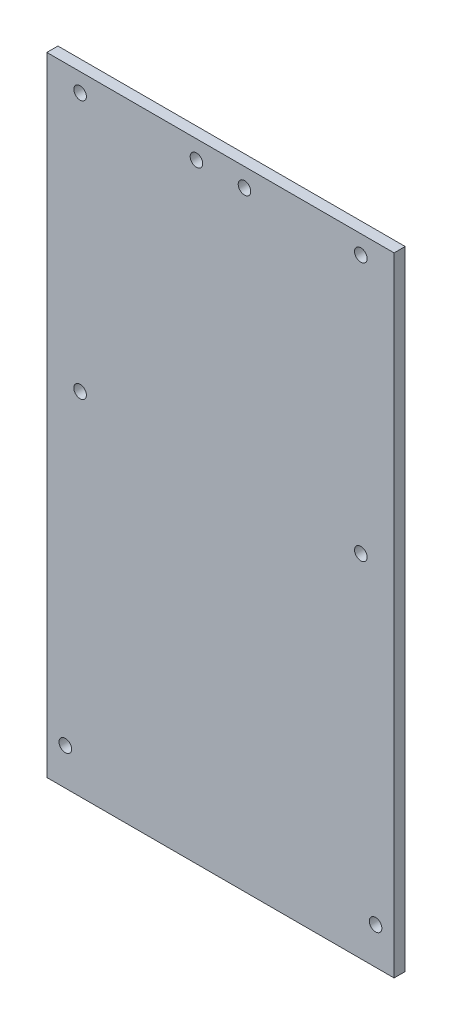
ISO-10303-21;
HEADER;
FILE_DESCRIPTION(('STEP AP214'),'2;1');
FILE_NAME('part.step','',(''),(''),'','','');
FILE_SCHEMA(('AUTOMOTIVE_DESIGN { 1 0 10303 214 1 1 1 1 }'));
ENDSEC;
DATA;
#1=APPLICATION_CONTEXT('core data for automotive mechanical design processes');
#2=APPLICATION_PROTOCOL_DEFINITION('international standard','automotive_design',2000,#1);
#3=PRODUCT_CONTEXT('',#1,'mechanical');
#4=PRODUCT('Part','Part','',(#3));
#5=PRODUCT_RELATED_PRODUCT_CATEGORY('part','',(#4));
#6=PRODUCT_DEFINITION_FORMATION('','',#4);
#7=PRODUCT_DEFINITION_CONTEXT('part definition',#1,'design');
#8=PRODUCT_DEFINITION('design','',#6,#7);
#9=PRODUCT_DEFINITION_SHAPE('','',#8);
#10=(LENGTH_UNIT() NAMED_UNIT(*) SI_UNIT(.MILLI.,.METRE.));
#11=(NAMED_UNIT(*) PLANE_ANGLE_UNIT() SI_UNIT($,.RADIAN.));
#12=(NAMED_UNIT(*) SI_UNIT($,.STERADIAN.) SOLID_ANGLE_UNIT());
#13=UNCERTAINTY_MEASURE_WITH_UNIT(LENGTH_MEASURE(1.E-05),#10,'distance_accuracy_value','');
#14=(GEOMETRIC_REPRESENTATION_CONTEXT(3) GLOBAL_UNCERTAINTY_ASSIGNED_CONTEXT((#13)) GLOBAL_UNIT_ASSIGNED_CONTEXT((#10,
#11,#12)) REPRESENTATION_CONTEXT('',''));
#15=CARTESIAN_POINT('',(0.,0.,0.));
#16=DIRECTION('',(0.,0.,1.));
#17=DIRECTION('',(1.,0.,0.));
#18=AXIS2_PLACEMENT_3D('',#15,#16,#17);
#19=CARTESIAN_POINT('',(47.,85.,3.));
#20=DIRECTION('',(-1.,0.,0.));
#21=DIRECTION('',(0.,-1.,0.));
#22=AXIS2_PLACEMENT_3D('',#19,#20,#21);
#23=PLANE('',#22);
#24=DIRECTION('',(0.,1.,0.));
#25=VECTOR('',#24,1.);
#26=CARTESIAN_POINT('',(47.,85.,0.));
#27=LINE('',#26,#25);
#28=CARTESIAN_POINT('',(47.,-85.,0.));
#29=VERTEX_POINT('',#28);
#30=CARTESIAN_POINT('',(47.,85.,0.));
#31=VERTEX_POINT('',#30);
#32=EDGE_CURVE('E97',#29,#31,#27,.T.);
#33=ORIENTED_EDGE('',*,*,#32,.T.);
#34=DIRECTION('',(0.,0.,-1.));
#35=VECTOR('',#34,1.);
#36=CARTESIAN_POINT('',(47.,85.,3.));
#37=LINE('',#36,#35);
#38=CARTESIAN_POINT('',(47.,85.,3.));
#39=VERTEX_POINT('',#38);
#40=EDGE_CURVE('E11',#39,#31,#37,.T.);
#41=ORIENTED_EDGE('',*,*,#40,.F.);
#42=DIRECTION('',(0.,1.,0.));
#43=VECTOR('',#42,1.);
#44=CARTESIAN_POINT('',(47.,85.,3.));
#45=LINE('',#44,#43);
#46=CARTESIAN_POINT('',(47.,-85.,3.));
#47=VERTEX_POINT('',#46);
#48=EDGE_CURVE('E85',#47,#39,#45,.T.);
#49=ORIENTED_EDGE('',*,*,#48,.F.);
#50=DIRECTION('',(0.,0.,-1.));
#51=VECTOR('',#50,1.);
#52=CARTESIAN_POINT('',(47.,-85.,3.));
#53=LINE('',#52,#51);
#54=EDGE_CURVE('E93',#47,#29,#53,.T.);
#55=ORIENTED_EDGE('',*,*,#54,.T.);
#56=EDGE_LOOP('',(#33,#41,#49,#55));
#57=FACE_BOUND('',#56,.T.);
#58=ADVANCED_FACE('F34',(#57),#23,.F.);
#59=CARTESIAN_POINT('',(-47.,85.,3.));
#60=DIRECTION('',(0.,-1.,0.));
#61=DIRECTION('',(0.,0.,-1.));
#62=AXIS2_PLACEMENT_3D('',#59,#60,#61);
#63=PLANE('',#62);
#64=DIRECTION('',(-1.,0.,0.));
#65=VECTOR('',#64,1.);
#66=CARTESIAN_POINT('',(-47.,85.,0.));
#67=LINE('',#66,#65);
#68=CARTESIAN_POINT('',(-47.,85.,0.));
#69=VERTEX_POINT('',#68);
#70=EDGE_CURVE('E89',#31,#69,#67,.T.);
#71=ORIENTED_EDGE('',*,*,#70,.T.);
#72=DIRECTION('',(0.,0.,-1.));
#73=VECTOR('',#72,1.);
#74=CARTESIAN_POINT('',(-47.,85.,3.));
#75=LINE('',#74,#73);
#76=CARTESIAN_POINT('',(-47.,85.,3.));
#77=VERTEX_POINT('',#76);
#78=EDGE_CURVE('E42',#77,#69,#75,.T.);
#79=ORIENTED_EDGE('',*,*,#78,.F.);
#80=DIRECTION('',(-1.,0.,0.));
#81=VECTOR('',#80,1.);
#82=CARTESIAN_POINT('',(-47.,85.,3.));
#83=LINE('',#82,#81);
#84=EDGE_CURVE('E80',#39,#77,#83,.T.);
#85=ORIENTED_EDGE('',*,*,#84,.F.);
#86=ORIENTED_EDGE('',*,*,#40,.T.);
#87=EDGE_LOOP('',(#71,#79,#85,#86));
#88=FACE_BOUND('',#87,.T.);
#89=ADVANCED_FACE('F88',(#88),#63,.F.);
#90=CARTESIAN_POINT('',(-47.,85.,3.));
#91=DIRECTION('',(1.,0.,0.));
#92=DIRECTION('',(0.,1.,0.));
#93=AXIS2_PLACEMENT_3D('',#90,#91,#92);
#94=PLANE('',#93);
#95=DIRECTION('',(0.,-1.,0.));
#96=VECTOR('',#95,1.);
#97=CARTESIAN_POINT('',(-47.,85.,0.));
#98=LINE('',#97,#96);
#99=CARTESIAN_POINT('',(-47.,-85.,0.));
#100=VERTEX_POINT('',#99);
#101=EDGE_CURVE('E67',#69,#100,#98,.T.);
#102=ORIENTED_EDGE('',*,*,#101,.T.);
#103=DIRECTION('',(0.,0.,-1.));
#104=VECTOR('',#103,1.);
#105=CARTESIAN_POINT('',(-47.,-85.,3.));
#106=LINE('',#105,#104);
#107=CARTESIAN_POINT('',(-47.,-85.,3.));
#108=VERTEX_POINT('',#107);
#109=EDGE_CURVE('E90',#108,#100,#106,.T.);
#110=ORIENTED_EDGE('',*,*,#109,.F.);
#111=DIRECTION('',(0.,-1.,0.));
#112=VECTOR('',#111,1.);
#113=CARTESIAN_POINT('',(-47.,85.,3.));
#114=LINE('',#113,#112);
#115=EDGE_CURVE('E83',#77,#108,#114,.T.);
#116=ORIENTED_EDGE('',*,*,#115,.F.);
#117=ORIENTED_EDGE('',*,*,#78,.T.);
#118=EDGE_LOOP('',(#102,#110,#116,#117));
#119=FACE_BOUND('',#118,.T.);
#120=ADVANCED_FACE('F91',(#119),#94,.F.);
#121=CARTESIAN_POINT('',(-47.,-85.,3.));
#122=DIRECTION('',(0.,1.,0.));
#123=DIRECTION('',(0.,0.,1.));
#124=AXIS2_PLACEMENT_3D('',#121,#122,#123);
#125=PLANE('',#124);
#126=DIRECTION('',(1.,0.,0.));
#127=VECTOR('',#126,1.);
#128=CARTESIAN_POINT('',(-47.,-85.,0.));
#129=LINE('',#128,#127);
#130=EDGE_CURVE('E73',#100,#29,#129,.T.);
#131=ORIENTED_EDGE('',*,*,#130,.T.);
#132=ORIENTED_EDGE('',*,*,#54,.F.);
#133=DIRECTION('',(1.,0.,0.));
#134=VECTOR('',#133,1.);
#135=CARTESIAN_POINT('',(-47.,-85.,3.));
#136=LINE('',#135,#134);
#137=EDGE_CURVE('E50',#108,#47,#136,.T.);
#138=ORIENTED_EDGE('',*,*,#137,.F.);
#139=ORIENTED_EDGE('',*,*,#109,.T.);
#140=EDGE_LOOP('',(#131,#132,#138,#139));
#141=FACE_BOUND('',#140,.T.);
#142=ADVANCED_FACE('F105',(#141),#125,.F.);
#143=CARTESIAN_POINT('',(0.,0.,3.));
#144=DIRECTION('',(0.,0.,1.));
#145=DIRECTION('',(1.,0.,0.));
#146=AXIS2_PLACEMENT_3D('',#143,#144,#145);
#147=PLANE('',#146);
#148=CARTESIAN_POINT('',(38.,80.,3.));
#149=DIRECTION('',(0.,0.,-1.));
#150=DIRECTION('',(-1.,0.,0.));
#151=AXIS2_PLACEMENT_3D('',#148,#149,#150);
#152=CIRCLE('',#151,1.69999999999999);
#153=CARTESIAN_POINT('',(36.3,80.,3.));
#154=VERTEX_POINT('',#153);
#155=EDGE_CURVE('E152',#154,#154,#152,.T.);
#156=ORIENTED_EDGE('',*,*,#155,.T.);
#157=EDGE_LOOP('',(#156));
#158=FACE_BOUND('',#157,.T.);
#159=CARTESIAN_POINT('',(-38.,80.,3.));
#160=DIRECTION('',(0.,0.,-1.));
#161=DIRECTION('',(-1.,0.,0.));
#162=AXIS2_PLACEMENT_3D('',#159,#160,#161);
#163=CIRCLE('',#162,1.69999999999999);
#164=CARTESIAN_POINT('',(-39.7,80.,3.));
#165=VERTEX_POINT('',#164);
#166=EDGE_CURVE('E146',#165,#165,#163,.T.);
#167=ORIENTED_EDGE('',*,*,#166,.T.);
#168=EDGE_LOOP('',(#167));
#169=FACE_BOUND('',#168,.T.);
#170=CARTESIAN_POINT('',(-38.,10.,3.));
#171=DIRECTION('',(0.,0.,-1.));
#172=DIRECTION('',(-1.,0.,0.));
#173=AXIS2_PLACEMENT_3D('',#170,#171,#172);
#174=CIRCLE('',#173,1.69999999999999);
#175=CARTESIAN_POINT('',(-39.7,10.,3.));
#176=VERTEX_POINT('',#175);
#177=EDGE_CURVE('E140',#176,#176,#174,.T.);
#178=ORIENTED_EDGE('',*,*,#177,.T.);
#179=EDGE_LOOP('',(#178));
#180=FACE_BOUND('',#179,.T.);
#181=CARTESIAN_POINT('',(38.,10.,3.));
#182=DIRECTION('',(0.,0.,-1.));
#183=DIRECTION('',(-1.,0.,0.));
#184=AXIS2_PLACEMENT_3D('',#181,#182,#183);
#185=CIRCLE('',#184,1.69999999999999);
#186=CARTESIAN_POINT('',(36.3,10.,3.));
#187=VERTEX_POINT('',#186);
#188=EDGE_CURVE('E134',#187,#187,#185,.T.);
#189=ORIENTED_EDGE('',*,*,#188,.T.);
#190=EDGE_LOOP('',(#189));
#191=FACE_BOUND('',#190,.T.);
#192=CARTESIAN_POINT('',(42.,-75.,3.));
#193=DIRECTION('',(0.,0.,-1.));
#194=DIRECTION('',(-1.,0.,0.));
#195=AXIS2_PLACEMENT_3D('',#192,#193,#194);
#196=CIRCLE('',#195,1.7);
#197=CARTESIAN_POINT('',(40.3,-75.,3.));
#198=VERTEX_POINT('',#197);
#199=EDGE_CURVE('E128',#198,#198,#196,.T.);
#200=ORIENTED_EDGE('',*,*,#199,.T.);
#201=EDGE_LOOP('',(#200));
#202=FACE_BOUND('',#201,.T.);
#203=CARTESIAN_POINT('',(-42.,-75.,3.));
#204=DIRECTION('',(0.,0.,-1.));
#205=DIRECTION('',(-1.,0.,0.));
#206=AXIS2_PLACEMENT_3D('',#203,#204,#205);
#207=CIRCLE('',#206,1.7);
#208=CARTESIAN_POINT('',(-43.7,-75.,3.));
#209=VERTEX_POINT('',#208);
#210=EDGE_CURVE('E122',#209,#209,#207,.T.);
#211=ORIENTED_EDGE('',*,*,#210,.T.);
#212=EDGE_LOOP('',(#211));
#213=FACE_BOUND('',#212,.T.);
#214=CARTESIAN_POINT('',(6.49999999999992,80.0000000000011,3.));
#215=DIRECTION('',(0.,0.,-1.));
#216=DIRECTION('',(-1.,0.,0.));
#217=AXIS2_PLACEMENT_3D('',#214,#215,#216);
#218=CIRCLE('',#217,1.7);
#219=CARTESIAN_POINT('',(4.79999999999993,80.0000000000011,3.));
#220=VERTEX_POINT('',#219);
#221=EDGE_CURVE('E116',#220,#220,#218,.T.);
#222=ORIENTED_EDGE('',*,*,#221,.T.);
#223=EDGE_LOOP('',(#222));
#224=FACE_BOUND('',#223,.T.);
#225=CARTESIAN_POINT('',(-6.50000000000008,80.0000000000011,3.));
#226=DIRECTION('',(0.,0.,-1.));
#227=DIRECTION('',(-1.,0.,0.));
#228=AXIS2_PLACEMENT_3D('',#225,#226,#227);
#229=CIRCLE('',#228,1.7);
#230=CARTESIAN_POINT('',(-8.20000000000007,80.0000000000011,3.));
#231=VERTEX_POINT('',#230);
#232=EDGE_CURVE('E100',#231,#231,#229,.T.);
#233=ORIENTED_EDGE('',*,*,#232,.T.);
#234=EDGE_LOOP('',(#233));
#235=FACE_BOUND('',#234,.T.);
#236=ORIENTED_EDGE('',*,*,#48,.T.);
#237=ORIENTED_EDGE('',*,*,#84,.T.);
#238=ORIENTED_EDGE('',*,*,#115,.T.);
#239=ORIENTED_EDGE('',*,*,#137,.T.);
#240=EDGE_LOOP('',(#236,#237,#238,#239));
#241=FACE_BOUND('',#240,.T.);
#242=ADVANCED_FACE('F81',(#158,#169,#180,#191,#202,#213,#224,#235,#241),#147,.T.);
#243=CARTESIAN_POINT('',(0.,0.,0.));
#244=DIRECTION('',(0.,0.,1.));
#245=DIRECTION('',(1.,0.,0.));
#246=AXIS2_PLACEMENT_3D('',#243,#244,#245);
#247=PLANE('',#246);
#248=CARTESIAN_POINT('',(38.,80.,0.));
#249=DIRECTION('',(0.,0.,-1.));
#250=DIRECTION('',(-1.,0.,0.));
#251=AXIS2_PLACEMENT_3D('',#248,#249,#250);
#252=CIRCLE('',#251,1.69999999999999);
#253=CARTESIAN_POINT('',(36.3,80.,0.));
#254=VERTEX_POINT('',#253);
#255=EDGE_CURVE('E155',#254,#254,#252,.T.);
#256=ORIENTED_EDGE('',*,*,#255,.F.);
#257=EDGE_LOOP('',(#256));
#258=FACE_BOUND('',#257,.T.);
#259=CARTESIAN_POINT('',(-38.,80.,0.));
#260=DIRECTION('',(0.,0.,-1.));
#261=DIRECTION('',(-1.,0.,0.));
#262=AXIS2_PLACEMENT_3D('',#259,#260,#261);
#263=CIRCLE('',#262,1.69999999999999);
#264=CARTESIAN_POINT('',(-39.7,80.,0.));
#265=VERTEX_POINT('',#264);
#266=EDGE_CURVE('E149',#265,#265,#263,.T.);
#267=ORIENTED_EDGE('',*,*,#266,.F.);
#268=EDGE_LOOP('',(#267));
#269=FACE_BOUND('',#268,.T.);
#270=CARTESIAN_POINT('',(-38.,10.,0.));
#271=DIRECTION('',(0.,0.,-1.));
#272=DIRECTION('',(-1.,0.,0.));
#273=AXIS2_PLACEMENT_3D('',#270,#271,#272);
#274=CIRCLE('',#273,1.69999999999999);
#275=CARTESIAN_POINT('',(-39.7,10.,0.));
#276=VERTEX_POINT('',#275);
#277=EDGE_CURVE('E143',#276,#276,#274,.T.);
#278=ORIENTED_EDGE('',*,*,#277,.F.);
#279=EDGE_LOOP('',(#278));
#280=FACE_BOUND('',#279,.T.);
#281=CARTESIAN_POINT('',(38.,10.,0.));
#282=DIRECTION('',(0.,0.,-1.));
#283=DIRECTION('',(-1.,0.,0.));
#284=AXIS2_PLACEMENT_3D('',#281,#282,#283);
#285=CIRCLE('',#284,1.69999999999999);
#286=CARTESIAN_POINT('',(36.3,10.,0.));
#287=VERTEX_POINT('',#286);
#288=EDGE_CURVE('E137',#287,#287,#285,.T.);
#289=ORIENTED_EDGE('',*,*,#288,.F.);
#290=EDGE_LOOP('',(#289));
#291=FACE_BOUND('',#290,.T.);
#292=CARTESIAN_POINT('',(42.,-75.,0.));
#293=DIRECTION('',(0.,0.,-1.));
#294=DIRECTION('',(-1.,0.,0.));
#295=AXIS2_PLACEMENT_3D('',#292,#293,#294);
#296=CIRCLE('',#295,1.69999999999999);
#297=CARTESIAN_POINT('',(40.3,-75.,0.));
#298=VERTEX_POINT('',#297);
#299=EDGE_CURVE('E131',#298,#298,#296,.T.);
#300=ORIENTED_EDGE('',*,*,#299,.F.);
#301=EDGE_LOOP('',(#300));
#302=FACE_BOUND('',#301,.T.);
#303=CARTESIAN_POINT('',(-42.,-75.,0.));
#304=DIRECTION('',(0.,0.,-1.));
#305=DIRECTION('',(-1.,0.,0.));
#306=AXIS2_PLACEMENT_3D('',#303,#304,#305);
#307=CIRCLE('',#306,1.69999999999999);
#308=CARTESIAN_POINT('',(-43.7,-75.,0.));
#309=VERTEX_POINT('',#308);
#310=EDGE_CURVE('E125',#309,#309,#307,.T.);
#311=ORIENTED_EDGE('',*,*,#310,.F.);
#312=EDGE_LOOP('',(#311));
#313=FACE_BOUND('',#312,.T.);
#314=CARTESIAN_POINT('',(6.49999999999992,80.0000000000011,0.));
#315=DIRECTION('',(0.,0.,-1.));
#316=DIRECTION('',(-1.,0.,0.));
#317=AXIS2_PLACEMENT_3D('',#314,#315,#316);
#318=CIRCLE('',#317,1.69999999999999);
#319=CARTESIAN_POINT('',(4.79999999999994,80.0000000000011,0.));
#320=VERTEX_POINT('',#319);
#321=EDGE_CURVE('E119',#320,#320,#318,.T.);
#322=ORIENTED_EDGE('',*,*,#321,.F.);
#323=EDGE_LOOP('',(#322));
#324=FACE_BOUND('',#323,.T.);
#325=CARTESIAN_POINT('',(-6.50000000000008,80.0000000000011,0.));
#326=DIRECTION('',(0.,0.,-1.));
#327=DIRECTION('',(-1.,0.,0.));
#328=AXIS2_PLACEMENT_3D('',#325,#326,#327);
#329=CIRCLE('',#328,1.69999999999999);
#330=CARTESIAN_POINT('',(-8.20000000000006,80.0000000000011,0.));
#331=VERTEX_POINT('',#330);
#332=EDGE_CURVE('E113',#331,#331,#329,.T.);
#333=ORIENTED_EDGE('',*,*,#332,.F.);
#334=EDGE_LOOP('',(#333));
#335=FACE_BOUND('',#334,.T.);
#336=ORIENTED_EDGE('',*,*,#32,.F.);
#337=ORIENTED_EDGE('',*,*,#130,.F.);
#338=ORIENTED_EDGE('',*,*,#101,.F.);
#339=ORIENTED_EDGE('',*,*,#70,.F.);
#340=EDGE_LOOP('',(#336,#337,#338,#339));
#341=FACE_BOUND('',#340,.T.);
#342=ADVANCED_FACE('F108',(#258,#269,#280,#291,#302,#313,#324,#335,#341),#247,.F.);
#343=CARTESIAN_POINT('',(-6.50000000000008,80.0000000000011,0.));
#344=DIRECTION('',(0.,0.,-1.));
#345=DIRECTION('',(-1.,0.,0.));
#346=AXIS2_PLACEMENT_3D('',#343,#344,#345);
#347=CYLINDRICAL_SURFACE('',#346,1.69999999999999);
#348=ORIENTED_EDGE('',*,*,#232,.F.);
#349=EDGE_LOOP('',(#348));
#350=FACE_BOUND('',#349,.T.);
#351=ORIENTED_EDGE('',*,*,#332,.T.);
#352=EDGE_LOOP('',(#351));
#353=FACE_BOUND('',#352,.T.);
#354=ADVANCED_FACE('F163',(#350,#353),#347,.F.);
#355=CARTESIAN_POINT('',(6.49999999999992,80.0000000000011,0.));
#356=DIRECTION('',(0.,0.,-1.));
#357=DIRECTION('',(-1.,0.,0.));
#358=AXIS2_PLACEMENT_3D('',#355,#356,#357);
#359=CYLINDRICAL_SURFACE('',#358,1.69999999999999);
#360=ORIENTED_EDGE('',*,*,#221,.F.);
#361=EDGE_LOOP('',(#360));
#362=FACE_BOUND('',#361,.T.);
#363=ORIENTED_EDGE('',*,*,#321,.T.);
#364=EDGE_LOOP('',(#363));
#365=FACE_BOUND('',#364,.T.);
#366=ADVANCED_FACE('F180',(#362,#365),#359,.F.);
#367=CARTESIAN_POINT('',(-42.,-75.,0.));
#368=DIRECTION('',(0.,0.,-1.));
#369=DIRECTION('',(-1.,0.,0.));
#370=AXIS2_PLACEMENT_3D('',#367,#368,#369);
#371=CYLINDRICAL_SURFACE('',#370,1.69999999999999);
#372=ORIENTED_EDGE('',*,*,#210,.F.);
#373=EDGE_LOOP('',(#372));
#374=FACE_BOUND('',#373,.T.);
#375=ORIENTED_EDGE('',*,*,#310,.T.);
#376=EDGE_LOOP('',(#375));
#377=FACE_BOUND('',#376,.T.);
#378=ADVANCED_FACE('F186',(#374,#377),#371,.F.);
#379=CARTESIAN_POINT('',(42.,-75.,0.));
#380=DIRECTION('',(0.,0.,-1.));
#381=DIRECTION('',(-1.,0.,0.));
#382=AXIS2_PLACEMENT_3D('',#379,#380,#381);
#383=CYLINDRICAL_SURFACE('',#382,1.69999999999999);
#384=ORIENTED_EDGE('',*,*,#199,.F.);
#385=EDGE_LOOP('',(#384));
#386=FACE_BOUND('',#385,.T.);
#387=ORIENTED_EDGE('',*,*,#299,.T.);
#388=EDGE_LOOP('',(#387));
#389=FACE_BOUND('',#388,.T.);
#390=ADVANCED_FACE('F223',(#386,#389),#383,.F.);
#391=CARTESIAN_POINT('',(38.,10.,0.));
#392=DIRECTION('',(0.,0.,-1.));
#393=DIRECTION('',(-1.,0.,0.));
#394=AXIS2_PLACEMENT_3D('',#391,#392,#393);
#395=CYLINDRICAL_SURFACE('',#394,1.69999999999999);
#396=ORIENTED_EDGE('',*,*,#188,.F.);
#397=EDGE_LOOP('',(#396));
#398=FACE_BOUND('',#397,.T.);
#399=ORIENTED_EDGE('',*,*,#288,.T.);
#400=EDGE_LOOP('',(#399));
#401=FACE_BOUND('',#400,.T.);
#402=ADVANCED_FACE('F228',(#398,#401),#395,.F.);
#403=CARTESIAN_POINT('',(-38.,10.,0.));
#404=DIRECTION('',(0.,0.,-1.));
#405=DIRECTION('',(-1.,0.,0.));
#406=AXIS2_PLACEMENT_3D('',#403,#404,#405);
#407=CYLINDRICAL_SURFACE('',#406,1.69999999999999);
#408=ORIENTED_EDGE('',*,*,#177,.F.);
#409=EDGE_LOOP('',(#408));
#410=FACE_BOUND('',#409,.T.);
#411=ORIENTED_EDGE('',*,*,#277,.T.);
#412=EDGE_LOOP('',(#411));
#413=FACE_BOUND('',#412,.T.);
#414=ADVANCED_FACE('F234',(#410,#413),#407,.F.);
#415=CARTESIAN_POINT('',(-38.,80.,0.));
#416=DIRECTION('',(0.,0.,-1.));
#417=DIRECTION('',(-1.,0.,0.));
#418=AXIS2_PLACEMENT_3D('',#415,#416,#417);
#419=CYLINDRICAL_SURFACE('',#418,1.69999999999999);
#420=ORIENTED_EDGE('',*,*,#166,.F.);
#421=EDGE_LOOP('',(#420));
#422=FACE_BOUND('',#421,.T.);
#423=ORIENTED_EDGE('',*,*,#266,.T.);
#424=EDGE_LOOP('',(#423));
#425=FACE_BOUND('',#424,.T.);
#426=ADVANCED_FACE('F238',(#422,#425),#419,.F.);
#427=CARTESIAN_POINT('',(38.,80.,0.));
#428=DIRECTION('',(0.,0.,-1.));
#429=DIRECTION('',(-1.,0.,0.));
#430=AXIS2_PLACEMENT_3D('',#427,#428,#429);
#431=CYLINDRICAL_SURFACE('',#430,1.69999999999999);
#432=ORIENTED_EDGE('',*,*,#155,.F.);
#433=EDGE_LOOP('',(#432));
#434=FACE_BOUND('',#433,.T.);
#435=ORIENTED_EDGE('',*,*,#255,.T.);
#436=EDGE_LOOP('',(#435));
#437=FACE_BOUND('',#436,.T.);
#438=ADVANCED_FACE('F159',(#434,#437),#431,.F.);
#439=CLOSED_SHELL('',(#58,#89,#120,#142,#242,#342,#354,#366,#378,#390,#402,#414,#426,#438));
#440=MANIFOLD_SOLID_BREP('B2',#439);
#441=ADVANCED_BREP_SHAPE_REPRESENTATION('',(#18,#440),#14);
#442=SHAPE_DEFINITION_REPRESENTATION(#9,#441);
ENDSEC;
END-ISO-10303-21;
